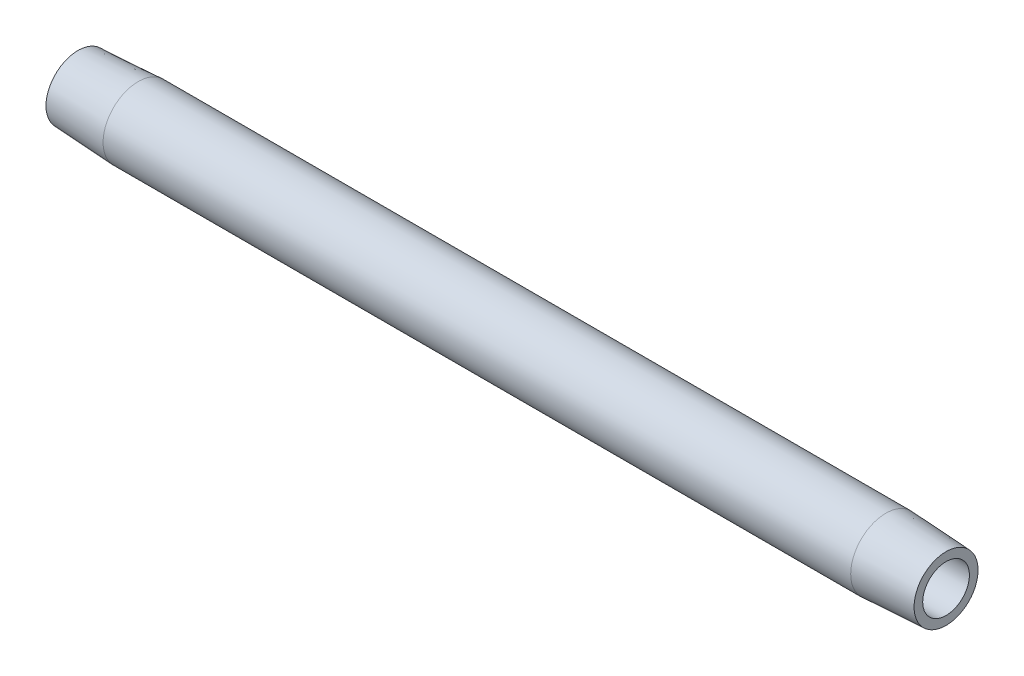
ISO-10303-21;
HEADER;
FILE_DESCRIPTION(('STEP AP214'),'2;1');
FILE_NAME('part.step','',(''),(''),'','','');
FILE_SCHEMA(('AUTOMOTIVE_DESIGN { 1 0 10303 214 1 1 1 1 }'));
ENDSEC;
DATA;
#1=APPLICATION_CONTEXT('core data for automotive mechanical design processes');
#2=APPLICATION_PROTOCOL_DEFINITION('international standard','automotive_design',2000,#1);
#3=PRODUCT_CONTEXT('',#1,'mechanical');
#4=PRODUCT('Part','Part','',(#3));
#5=PRODUCT_RELATED_PRODUCT_CATEGORY('part','',(#4));
#6=PRODUCT_DEFINITION_FORMATION('','',#4);
#7=PRODUCT_DEFINITION_CONTEXT('part definition',#1,'design');
#8=PRODUCT_DEFINITION('design','',#6,#7);
#9=PRODUCT_DEFINITION_SHAPE('','',#8);
#10=(LENGTH_UNIT() NAMED_UNIT(*) SI_UNIT(.MILLI.,.METRE.));
#11=(NAMED_UNIT(*) PLANE_ANGLE_UNIT() SI_UNIT($,.RADIAN.));
#12=(NAMED_UNIT(*) SI_UNIT($,.STERADIAN.) SOLID_ANGLE_UNIT());
#13=UNCERTAINTY_MEASURE_WITH_UNIT(LENGTH_MEASURE(1.E-05),#10,'distance_accuracy_value','');
#14=(GEOMETRIC_REPRESENTATION_CONTEXT(3) GLOBAL_UNCERTAINTY_ASSIGNED_CONTEXT((#13)) GLOBAL_UNIT_ASSIGNED_CONTEXT((#10,
#11,#12)) REPRESENTATION_CONTEXT('',''));
#15=CARTESIAN_POINT('',(0.,0.,0.));
#16=DIRECTION('',(0.,0.,1.));
#17=DIRECTION('',(1.,0.,0.));
#18=AXIS2_PLACEMENT_3D('',#15,#16,#17);
#19=CARTESIAN_POINT('',(0.476141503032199,0.,0.));
#20=DIRECTION('',(-1.,0.,0.));
#21=DIRECTION('',(0.,0.,1.));
#22=AXIS2_PLACEMENT_3D('',#19,#20,#21);
#23=CYLINDRICAL_SURFACE('',#22,5.14349999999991);
#24=CARTESIAN_POINT('',(8.8100393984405,0.,0.));
#25=DIRECTION('',(-1.,0.,0.));
#26=DIRECTION('',(0.,0.,1.));
#27=AXIS2_PLACEMENT_3D('',#24,#25,#26);
#28=CIRCLE('',#27,5.14349999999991);
#29=CARTESIAN_POINT('',(8.8100393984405,0.,5.14349999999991));
#30=VERTEX_POINT('',#29);
#31=EDGE_CURVE('E10',#30,#30,#28,.T.);
#32=ORIENTED_EDGE('',*,*,#31,.F.);
#33=EDGE_LOOP('',(#32));
#34=FACE_BOUND('',#33,.T.);
#35=CARTESIAN_POINT('',(118.189960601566,0.,0.));
#36=DIRECTION('',(-1.,0.,0.));
#37=DIRECTION('',(0.,0.,1.));
#38=AXIS2_PLACEMENT_3D('',#35,#36,#37);
#39=CIRCLE('',#38,5.14349999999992);
#40=CARTESIAN_POINT('',(118.189960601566,0.,5.14349999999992));
#41=VERTEX_POINT('',#40);
#42=EDGE_CURVE('E52',#41,#41,#39,.T.);
#43=ORIENTED_EDGE('',*,*,#42,.T.);
#44=EDGE_LOOP('',(#43));
#45=FACE_BOUND('',#44,.T.);
#46=ADVANCED_FACE('F30',(#34,#45),#23,.T.);
#47=CARTESIAN_POINT('',(8.8100393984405,0.,0.));
#48=DIRECTION('',(1.,0.,0.));
#49=DIRECTION('',(0.,0.,-1.));
#50=AXIS2_PLACEMENT_3D('',#47,#48,#49);
#51=CONICAL_SURFACE('',#50,5.14349999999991,0.0523598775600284);
#52=CARTESIAN_POINT('',(0.,0.,0.));
#53=DIRECTION('',(-1.,0.,0.));
#54=DIRECTION('',(0.,0.,1.));
#55=AXIS2_PLACEMENT_3D('',#52,#53,#54);
#56=CIRCLE('',#55,4.68178539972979);
#57=CARTESIAN_POINT('',(0.,0.,4.68178539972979));
#58=VERTEX_POINT('',#57);
#59=EDGE_CURVE('E36',#58,#58,#56,.T.);
#60=ORIENTED_EDGE('',*,*,#59,.F.);
#61=EDGE_LOOP('',(#60));
#62=FACE_BOUND('',#61,.T.);
#63=ORIENTED_EDGE('',*,*,#31,.T.);
#64=EDGE_LOOP('',(#63));
#65=FACE_BOUND('',#64,.T.);
#66=ADVANCED_FACE('F77',(#62,#65),#51,.T.);
#67=CARTESIAN_POINT('',(0.,4.68178539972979,0.));
#68=DIRECTION('',(1.,0.,0.));
#69=DIRECTION('',(0.,0.,-1.));
#70=AXIS2_PLACEMENT_3D('',#67,#68,#69);
#71=PLANE('',#70);
#72=CARTESIAN_POINT('',(0.,0.,0.));
#73=DIRECTION('',(-1.,0.,0.));
#74=DIRECTION('',(0.,0.,1.));
#75=AXIS2_PLACEMENT_3D('',#72,#73,#74);
#76=CIRCLE('',#75,3.4163);
#77=CARTESIAN_POINT('',(0.,0.,3.4163));
#78=VERTEX_POINT('',#77);
#79=EDGE_CURVE('E40',#78,#78,#76,.T.);
#80=ORIENTED_EDGE('',*,*,#79,.F.);
#81=EDGE_LOOP('',(#80));
#82=FACE_BOUND('',#81,.T.);
#83=ORIENTED_EDGE('',*,*,#59,.T.);
#84=EDGE_LOOP('',(#83));
#85=FACE_BOUND('',#84,.T.);
#86=ADVANCED_FACE('F72',(#82,#85),#71,.F.);
#87=CARTESIAN_POINT('',(0.476141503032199,0.,0.));
#88=DIRECTION('',(-1.,0.,0.));
#89=DIRECTION('',(0.,0.,1.));
#90=AXIS2_PLACEMENT_3D('',#87,#88,#89);
#91=CYLINDRICAL_SURFACE('',#90,3.4163);
#92=CARTESIAN_POINT('',(127.,0.,0.));
#93=DIRECTION('',(-1.,0.,0.));
#94=DIRECTION('',(0.,0.,1.));
#95=AXIS2_PLACEMENT_3D('',#92,#93,#94);
#96=CIRCLE('',#95,3.4163);
#97=CARTESIAN_POINT('',(127.,0.,3.4163));
#98=VERTEX_POINT('',#97);
#99=EDGE_CURVE('E44',#98,#98,#96,.T.);
#100=ORIENTED_EDGE('',*,*,#99,.F.);
#101=EDGE_LOOP('',(#100));
#102=FACE_BOUND('',#101,.T.);
#103=ORIENTED_EDGE('',*,*,#79,.T.);
#104=EDGE_LOOP('',(#103));
#105=FACE_BOUND('',#104,.T.);
#106=ADVANCED_FACE('F66',(#102,#105),#91,.F.);
#107=CARTESIAN_POINT('',(127.,3.4163,0.));
#108=DIRECTION('',(-1.,0.,0.));
#109=DIRECTION('',(0.,0.,1.));
#110=AXIS2_PLACEMENT_3D('',#107,#108,#109);
#111=PLANE('',#110);
#112=CARTESIAN_POINT('',(127.,0.,0.));
#113=DIRECTION('',(-1.,0.,0.));
#114=DIRECTION('',(0.,0.,1.));
#115=AXIS2_PLACEMENT_3D('',#112,#113,#114);
#116=CIRCLE('',#115,4.68178539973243);
#117=CARTESIAN_POINT('',(127.,0.,4.68178539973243));
#118=VERTEX_POINT('',#117);
#119=EDGE_CURVE('E49',#118,#118,#116,.T.);
#120=ORIENTED_EDGE('',*,*,#119,.F.);
#121=EDGE_LOOP('',(#120));
#122=FACE_BOUND('',#121,.T.);
#123=ORIENTED_EDGE('',*,*,#99,.T.);
#124=EDGE_LOOP('',(#123));
#125=FACE_BOUND('',#124,.T.);
#126=ADVANCED_FACE('F60',(#122,#125),#111,.F.);
#127=CARTESIAN_POINT('',(127.,0.,0.));
#128=DIRECTION('',(-1.,0.,0.));
#129=DIRECTION('',(0.,0.,1.));
#130=AXIS2_PLACEMENT_3D('',#127,#128,#129);
#131=CONICAL_SURFACE('',#130,4.68178539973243,0.0523598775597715);
#132=ORIENTED_EDGE('',*,*,#42,.F.);
#133=EDGE_LOOP('',(#132));
#134=FACE_BOUND('',#133,.T.);
#135=ORIENTED_EDGE('',*,*,#119,.T.);
#136=EDGE_LOOP('',(#135));
#137=FACE_BOUND('',#136,.T.);
#138=ADVANCED_FACE('F57',(#134,#137),#131,.T.);
#139=CLOSED_SHELL('',(#46,#66,#86,#106,#126,#138));
#140=MANIFOLD_SOLID_BREP('B2',#139);
#141=ADVANCED_BREP_SHAPE_REPRESENTATION('',(#18,#140),#14);
#142=SHAPE_DEFINITION_REPRESENTATION(#9,#141);
ENDSEC;
END-ISO-10303-21;
